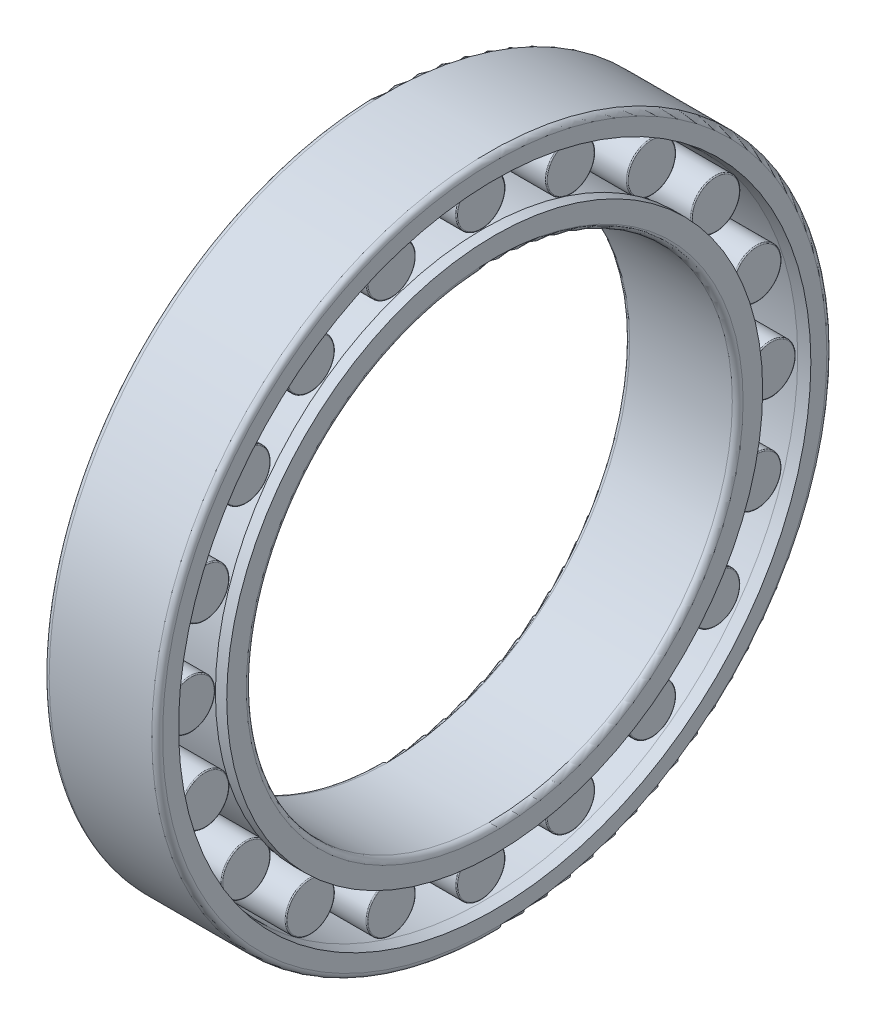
from build123d import *

# Parameters (mm, degrees)
ROLLERSDETAILED_COUNT = 20
ROLLERSDETAILED_ANGLE = 342


with BuildPart() as part:
    # OutRacSke → OuterRace (revolve)
    with BuildSketch(Plane.XY, mode=Mode.PRIVATE) as outerrace_sk:
        with BuildLine():
            Line((16.8, 116.42), (21, 117.086666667))
            Line((21, 117.086666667), (21, 123))
            ThreePointArc((21, 123), (20.414213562, 124.414213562), (19, 125))
            Line((19, 125), (-19, 125))
            ThreePointArc((-19, 125), (-20.414213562, 124.414213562), (-21, 123))
            Line((-21, 123), (-21, 117.086666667))
            Line((-21, 117.086666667), (-16.8, 116.42))
            Line((-16.8, 116.42), (16.8, 116.42))
        make_face()
    revolve(outerrace_sk.sketch.rotate(Axis((-90, 0, 0), (1, 0, 0)), 270), axis=Axis((-90, 0, 0), (1, 0, 0)))

    # RolDetSke → RollerDetailed (revolve)
    with BuildSketch(Plane.XY, mode=Mode.PRIVATE) as rollerdetailed_sk:
        with BuildLine():
            Line((-15.96, 116.18512), (-15.96, 107.5))
            Line((-15.96, 107.5), (15.96, 107.5))
            Line((15.96, 107.5), (15.96, 116.18512))
            ThreePointArc((15.96, 116.18512), (15.854007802, 116.441007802), (15.59812, 116.547))
            Line((15.59812, 116.547), (-15.59812, 116.547))
            ThreePointArc((-15.59812, 116.547), (-15.854007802, 116.441007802), (-15.96, 116.18512))
        make_face()
    rollerdetailed = revolve(rollerdetailed_sk.sketch.rotate(Axis((-33.6, 107.5, 0), (1, 0, 0)), 270), axis=Axis((-33.6, 107.5, 0), (1, 0, 0)))

    # InsRacSke → InnerRace (revolve)
    with BuildSketch(Plane.XY, mode=Mode.PRIVATE) as innerrace_sk:
        with BuildLine():
            Line((16.8, 98.58), (16.8, 99.246666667))
            Line((16.8, 99.246666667), (21, 99.246666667))
            Line((21, 99.246666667), (21, 92))
            ThreePointArc((21, 92), (20.414213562, 90.585786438), (19, 90))
            Line((19, 90), (-19, 90))
            ThreePointArc((-19, 90), (-20.414213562, 90.585786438), (-21, 92))
            Line((-21, 92), (-21, 99.246666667))
            Line((-21, 99.246666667), (-16.8, 99.246666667))
            Line((-16.8, 99.246666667), (-16.8, 98.58))
            Line((-16.8, 98.58), (16.8, 98.58))
        make_face()
    revolve(innerrace_sk.sketch.rotate(Axis((-90, 0, 0), (1, 0, 0)), 270), axis=Axis((-90, 0, 0), (1, 0, 0)))

    # RollersDetailed: RollerDetailed ×20 about axis
    rollersdetailed_axis = Axis((-50, 0, 0), (1, 0, 0))
    for i in range(1, ROLLERSDETAILED_COUNT):
        add(rollerdetailed.rotate(rollersdetailed_axis, i * ROLLERSDETAILED_ANGLE / (ROLLERSDETAILED_COUNT - 1)))


solid = part.part
